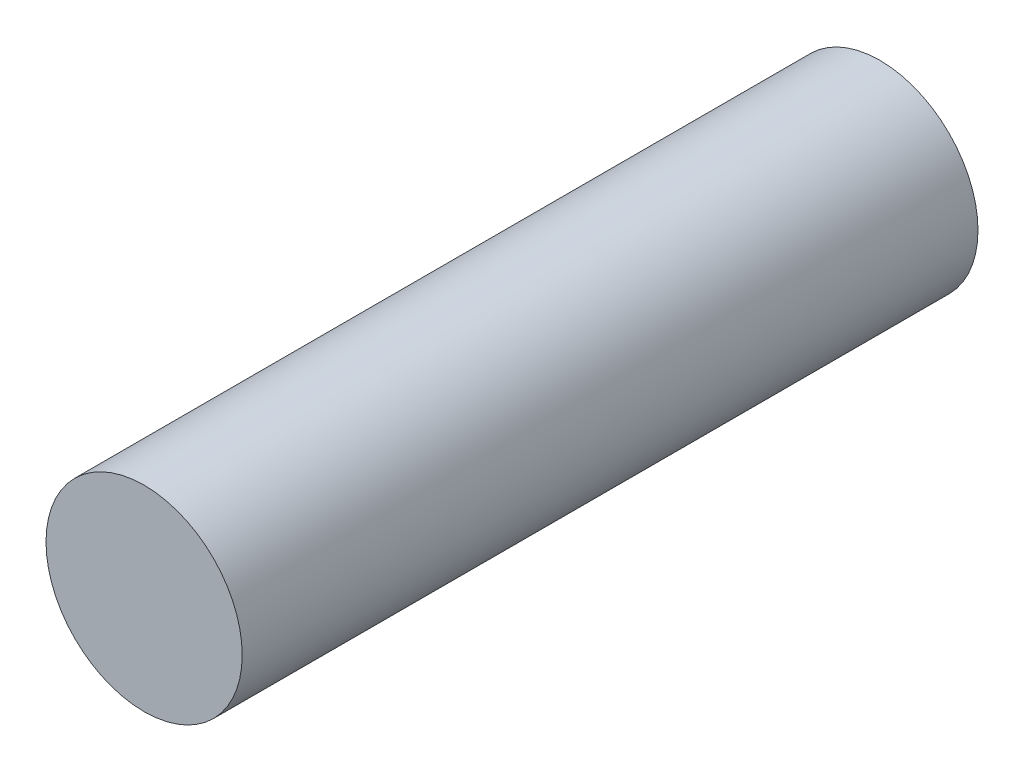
from build123d import *

# Parameters (mm, degrees)
SKETCH1_R          = 10.16
BASE_EXTRUDE_DEPTH = 76.2


with BuildPart() as part:
    # Sketch1 → Base-Extrude (new body)
    with BuildSketch(Plane.XY):
        Circle(SKETCH1_R)
    extrude(amount=-BASE_EXTRUDE_DEPTH)


solid = part.part
